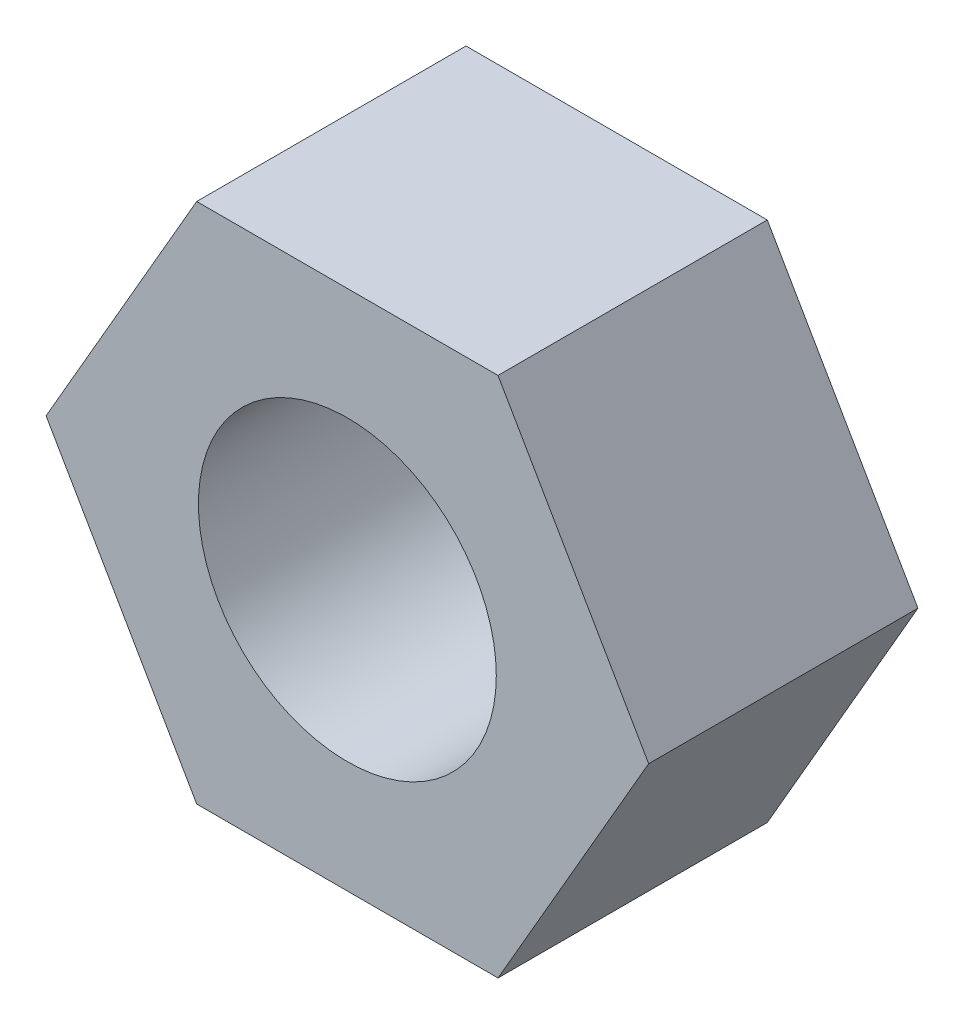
ISO-10303-21;
HEADER;
FILE_DESCRIPTION(('STEP AP214'),'2;1');
FILE_NAME('part.step','',(''),(''),'','','');
FILE_SCHEMA(('AUTOMOTIVE_DESIGN { 1 0 10303 214 1 1 1 1 }'));
ENDSEC;
DATA;
#1=APPLICATION_CONTEXT('core data for automotive mechanical design processes');
#2=APPLICATION_PROTOCOL_DEFINITION('international standard','automotive_design',2000,#1);
#3=PRODUCT_CONTEXT('',#1,'mechanical');
#4=PRODUCT('Part','Part','',(#3));
#5=PRODUCT_RELATED_PRODUCT_CATEGORY('part','',(#4));
#6=PRODUCT_DEFINITION_FORMATION('','',#4);
#7=PRODUCT_DEFINITION_CONTEXT('part definition',#1,'design');
#8=PRODUCT_DEFINITION('design','',#6,#7);
#9=PRODUCT_DEFINITION_SHAPE('','',#8);
#10=(LENGTH_UNIT() NAMED_UNIT(*) SI_UNIT(.MILLI.,.METRE.));
#11=(NAMED_UNIT(*) PLANE_ANGLE_UNIT() SI_UNIT($,.RADIAN.));
#12=(NAMED_UNIT(*) SI_UNIT($,.STERADIAN.) SOLID_ANGLE_UNIT());
#13=UNCERTAINTY_MEASURE_WITH_UNIT(LENGTH_MEASURE(1.E-05),#10,'distance_accuracy_value','');
#14=(GEOMETRIC_REPRESENTATION_CONTEXT(3) GLOBAL_UNCERTAINTY_ASSIGNED_CONTEXT((#13)) GLOBAL_UNIT_ASSIGNED_CONTEXT((#10,
#11,#12)) REPRESENTATION_CONTEXT('',''));
#15=CARTESIAN_POINT('',(0.,0.,0.));
#16=DIRECTION('',(0.,0.,1.));
#17=DIRECTION('',(1.,0.,0.));
#18=AXIS2_PLACEMENT_3D('',#15,#16,#17);
#19=CARTESIAN_POINT('',(-3.21156860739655,-5.56260000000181,5.74040000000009));
#20=DIRECTION('',(0.,1.00000000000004,0.));
#21=DIRECTION('',(-1.00000000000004,0.,0.));
#22=AXIS2_PLACEMENT_3D('',#19,#20,#21);
#23=PLANE('',#22);
#24=DIRECTION('',(1.00000000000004,0.,0.));
#25=VECTOR('',#24,1.);
#26=CARTESIAN_POINT('',(-3.21156860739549,-5.56260000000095,-2.77555756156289E-13));
#27=LINE('',#26,#25);
#28=CARTESIAN_POINT('',(-3.21156860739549,-5.56260000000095,-2.77555756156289E-13));
#29=VERTEX_POINT('',#28);
#30=CARTESIAN_POINT('',(3.21156860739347,-5.56260000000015,7.7715611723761E-13));
#31=VERTEX_POINT('',#30);
#32=EDGE_CURVE('E88',#29,#31,#27,.T.);
#33=ORIENTED_EDGE('',*,*,#32,.T.);
#34=DIRECTION('',(0.,0.,-1.));
#35=VECTOR('',#34,1.);
#36=CARTESIAN_POINT('',(3.21156860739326,-5.56259999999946,5.74039999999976));
#37=LINE('',#36,#35);
#38=CARTESIAN_POINT('',(3.21156860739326,-5.56259999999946,5.74039999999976));
#39=VERTEX_POINT('',#38);
#40=EDGE_CURVE('E11',#39,#31,#37,.T.);
#41=ORIENTED_EDGE('',*,*,#40,.F.);
#42=DIRECTION('',(1.00000000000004,0.,0.));
#43=VECTOR('',#42,1.);
#44=CARTESIAN_POINT('',(-3.21156860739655,-5.56260000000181,5.74040000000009));
#45=LINE('',#44,#43);
#46=CARTESIAN_POINT('',(-3.21156860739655,-5.56260000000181,5.74040000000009));
#47=VERTEX_POINT('',#46);
#48=EDGE_CURVE('E116',#47,#39,#45,.T.);
#49=ORIENTED_EDGE('',*,*,#48,.F.);
#50=DIRECTION('',(0.,0.,-1.));
#51=VECTOR('',#50,1.);
#52=CARTESIAN_POINT('',(-3.21156860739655,-5.56260000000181,5.74040000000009));
#53=LINE('',#52,#51);
#54=EDGE_CURVE('E101',#47,#29,#53,.T.);
#55=ORIENTED_EDGE('',*,*,#54,.T.);
#56=EDGE_LOOP('',(#33,#41,#49,#55));
#57=FACE_BOUND('',#56,.T.);
#58=ADVANCED_FACE('F32',(#57),#23,.F.);
#59=CARTESIAN_POINT('',(3.21156860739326,-5.56259999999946,5.74039999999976));
#60=DIRECTION('',(-0.866025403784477,0.500000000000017,0.));
#61=DIRECTION('',(-0.500000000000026,-0.866025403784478,0.));
#62=AXIS2_PLACEMENT_3D('',#59,#60,#61);
#63=PLANE('',#62);
#64=DIRECTION('',(0.500000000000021,0.866025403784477,0.));
#65=VECTOR('',#64,1.);
#66=CARTESIAN_POINT('',(3.21156860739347,-5.56260000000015,7.7715611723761E-13));
#67=LINE('',#66,#65);
#68=CARTESIAN_POINT('',(6.42313721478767,-2.2065682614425E-12,-5.55111512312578E-13));
#69=VERTEX_POINT('',#68);
#70=EDGE_CURVE('E84',#31,#69,#67,.T.);
#71=ORIENTED_EDGE('',*,*,#70,.T.);
#72=DIRECTION('',(0.,0.,-1.));
#73=VECTOR('',#72,1.);
#74=CARTESIAN_POINT('',(6.42313721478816,9.99200722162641E-13,5.74040000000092));
#75=LINE('',#74,#73);
#76=CARTESIAN_POINT('',(6.42313721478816,9.99200722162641E-13,5.74040000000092));
#77=VERTEX_POINT('',#76);
#78=EDGE_CURVE('E39',#77,#69,#75,.T.);
#79=ORIENTED_EDGE('',*,*,#78,.F.);
#80=DIRECTION('',(0.500000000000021,0.866025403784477,0.));
#81=VECTOR('',#80,1.);
#82=CARTESIAN_POINT('',(3.21156860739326,-5.56259999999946,5.74039999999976));
#83=LINE('',#82,#81);
#84=EDGE_CURVE('E97',#39,#77,#83,.T.);
#85=ORIENTED_EDGE('',*,*,#84,.F.);
#86=ORIENTED_EDGE('',*,*,#40,.T.);
#87=EDGE_LOOP('',(#71,#79,#85,#86));
#88=FACE_BOUND('',#87,.T.);
#89=ADVANCED_FACE('F96',(#88),#63,.F.);
#90=CARTESIAN_POINT('',(6.42313721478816,9.99200722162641E-13,5.74040000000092));
#91=DIRECTION('',(-0.866025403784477,-0.500000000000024,0.));
#92=DIRECTION('',(0.500000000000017,-0.866025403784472,0.));
#93=AXIS2_PLACEMENT_3D('',#90,#91,#92);
#94=PLANE('',#93);
#95=DIRECTION('',(-0.500000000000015,0.86602540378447,0.));
#96=VECTOR('',#95,1.);
#97=CARTESIAN_POINT('',(6.42313721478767,-2.2065682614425E-12,-5.55111512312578E-13));
#98=LINE('',#97,#96);
#99=CARTESIAN_POINT('',(3.21156860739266,5.5626000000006,1.88737914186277E-12));
#100=VERTEX_POINT('',#99);
#101=EDGE_CURVE('E90',#69,#100,#98,.T.);
#102=ORIENTED_EDGE('',*,*,#101,.T.);
#103=DIRECTION('',(0.,0.,-1.));
#104=VECTOR('',#103,1.);
#105=CARTESIAN_POINT('',(3.21156860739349,5.56260000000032,5.74040000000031));
#106=LINE('',#105,#104);
#107=CARTESIAN_POINT('',(3.21156860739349,5.56260000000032,5.74040000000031));
#108=VERTEX_POINT('',#107);
#109=EDGE_CURVE('E132',#108,#100,#106,.T.);
#110=ORIENTED_EDGE('',*,*,#109,.F.);
#111=DIRECTION('',(-0.500000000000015,0.86602540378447,0.));
#112=VECTOR('',#111,1.);
#113=CARTESIAN_POINT('',(6.42313721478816,9.99200722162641E-13,5.74040000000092));
#114=LINE('',#113,#112);
#115=EDGE_CURVE('E119',#77,#108,#114,.T.);
#116=ORIENTED_EDGE('',*,*,#115,.F.);
#117=ORIENTED_EDGE('',*,*,#78,.T.);
#118=EDGE_LOOP('',(#102,#110,#116,#117));
#119=FACE_BOUND('',#118,.T.);
#120=ADVANCED_FACE('F136',(#119),#94,.F.);
#121=CARTESIAN_POINT('',(3.21156860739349,5.56260000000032,5.74040000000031));
#122=DIRECTION('',(0.,-1.00000000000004,0.));
#123=DIRECTION('',(1.00000000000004,0.,0.));
#124=AXIS2_PLACEMENT_3D('',#121,#122,#123);
#125=PLANE('',#124);
#126=DIRECTION('',(-1.00000000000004,0.,0.));
#127=VECTOR('',#126,1.);
#128=CARTESIAN_POINT('',(3.21156860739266,5.5626000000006,1.88737914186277E-12));
#129=LINE('',#128,#127);
#130=CARTESIAN_POINT('',(-3.21156860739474,5.56259999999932,-2.22044604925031E-13));
#131=VERTEX_POINT('',#130);
#132=EDGE_CURVE('E110',#100,#131,#129,.T.);
#133=ORIENTED_EDGE('',*,*,#132,.T.);
#134=DIRECTION('',(0.,0.,-1.));
#135=VECTOR('',#134,1.);
#136=CARTESIAN_POINT('',(-3.21156860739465,5.56259999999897,5.74039999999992));
#137=LINE('',#136,#135);
#138=CARTESIAN_POINT('',(-3.21156860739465,5.56259999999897,5.74039999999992));
#139=VERTEX_POINT('',#138);
#140=EDGE_CURVE('E129',#139,#131,#137,.T.);
#141=ORIENTED_EDGE('',*,*,#140,.F.);
#142=DIRECTION('',(-1.00000000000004,0.,0.));
#143=VECTOR('',#142,1.);
#144=CARTESIAN_POINT('',(3.21156860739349,5.56260000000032,5.74040000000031));
#145=LINE('',#144,#143);
#146=EDGE_CURVE('E121',#108,#139,#145,.T.);
#147=ORIENTED_EDGE('',*,*,#146,.F.);
#148=ORIENTED_EDGE('',*,*,#109,.T.);
#149=EDGE_LOOP('',(#133,#141,#147,#148));
#150=FACE_BOUND('',#149,.T.);
#151=ADVANCED_FACE('F142',(#150),#125,.F.);
#152=CARTESIAN_POINT('',(-3.21156860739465,5.56259999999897,5.74039999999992));
#153=DIRECTION('',(0.866025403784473,-0.500000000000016,0.));
#154=DIRECTION('',(0.500000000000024,0.866025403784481,0.));
#155=AXIS2_PLACEMENT_3D('',#152,#153,#154);
#156=PLANE('',#155);
#157=DIRECTION('',(-0.500000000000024,-0.866025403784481,0.));
#158=VECTOR('',#157,1.);
#159=CARTESIAN_POINT('',(-3.21156860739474,5.56259999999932,-2.22044604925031E-13));
#160=LINE('',#159,#158);
#161=CARTESIAN_POINT('',(-6.42313721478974,-3.7470027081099E-13,-8.88178419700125E-13));
#162=VERTEX_POINT('',#161);
#163=EDGE_CURVE('E112',#131,#162,#160,.T.);
#164=ORIENTED_EDGE('',*,*,#163,.T.);
#165=DIRECTION('',(0.,0.,-1.));
#166=VECTOR('',#165,1.);
#167=CARTESIAN_POINT('',(-6.42313721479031,-1.40165656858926E-12,5.74039999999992));
#168=LINE('',#167,#166);
#169=CARTESIAN_POINT('',(-6.42313721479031,-1.40165656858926E-12,5.74039999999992));
#170=VERTEX_POINT('',#169);
#171=EDGE_CURVE('E126',#170,#162,#168,.T.);
#172=ORIENTED_EDGE('',*,*,#171,.F.);
#173=DIRECTION('',(-0.500000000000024,-0.866025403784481,0.));
#174=VECTOR('',#173,1.);
#175=CARTESIAN_POINT('',(-3.21156860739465,5.56259999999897,5.74039999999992));
#176=LINE('',#175,#174);
#177=EDGE_CURVE('E51',#139,#170,#176,.T.);
#178=ORIENTED_EDGE('',*,*,#177,.F.);
#179=ORIENTED_EDGE('',*,*,#140,.T.);
#180=EDGE_LOOP('',(#164,#172,#178,#179));
#181=FACE_BOUND('',#180,.T.);
#182=ADVANCED_FACE('F145',(#181),#156,.F.);
#183=CARTESIAN_POINT('',(-6.42313721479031,-1.40165656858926E-12,5.74039999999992));
#184=DIRECTION('',(0.866025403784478,0.500000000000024,0.));
#185=DIRECTION('',(-0.500000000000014,0.866025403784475,0.));
#186=AXIS2_PLACEMENT_3D('',#183,#184,#185);
#187=PLANE('',#186);
#188=DIRECTION('',(0.500000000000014,-0.866025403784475,0.));
#189=VECTOR('',#188,1.);
#190=CARTESIAN_POINT('',(-6.42313721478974,-3.7470027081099E-13,-8.88178419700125E-13));
#191=LINE('',#190,#189);
#192=EDGE_CURVE('E114',#162,#29,#191,.T.);
#193=ORIENTED_EDGE('',*,*,#192,.T.);
#194=ORIENTED_EDGE('',*,*,#54,.F.);
#195=DIRECTION('',(0.500000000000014,-0.866025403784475,0.));
#196=VECTOR('',#195,1.);
#197=CARTESIAN_POINT('',(-6.42313721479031,-1.40165656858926E-12,5.74039999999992));
#198=LINE('',#197,#196);
#199=EDGE_CURVE('E46',#170,#47,#198,.T.);
#200=ORIENTED_EDGE('',*,*,#199,.F.);
#201=ORIENTED_EDGE('',*,*,#171,.T.);
#202=EDGE_LOOP('',(#193,#194,#200,#201));
#203=FACE_BOUND('',#202,.T.);
#204=ADVANCED_FACE('F147',(#203),#187,.F.);
#205=CARTESIAN_POINT('',(-3.21156860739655,-5.56260000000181,5.74040000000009));
#206=DIRECTION('',(0.,0.,-1.));
#207=DIRECTION('',(-1.00000000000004,0.,0.));
#208=AXIS2_PLACEMENT_3D('',#205,#206,#207);
#209=PLANE('',#208);
#210=CARTESIAN_POINT('',(-6.48786580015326E-13,0.,5.74039999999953));
#211=DIRECTION('',(0.,0.,1.));
#212=DIRECTION('',(1.00000000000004,0.,0.));
#213=AXIS2_PLACEMENT_3D('',#210,#211,#212);
#214=CIRCLE('',#213,3.175);
#215=CARTESIAN_POINT('',(3.17499999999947,0.,5.74039999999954));
#216=VERTEX_POINT('',#215);
#217=EDGE_CURVE('E105',#216,#216,#214,.T.);
#218=ORIENTED_EDGE('',*,*,#217,.F.);
#219=EDGE_LOOP('',(#218));
#220=FACE_BOUND('',#219,.T.);
#221=ORIENTED_EDGE('',*,*,#48,.T.);
#222=ORIENTED_EDGE('',*,*,#84,.T.);
#223=ORIENTED_EDGE('',*,*,#115,.T.);
#224=ORIENTED_EDGE('',*,*,#146,.T.);
#225=ORIENTED_EDGE('',*,*,#177,.T.);
#226=ORIENTED_EDGE('',*,*,#199,.T.);
#227=EDGE_LOOP('',(#221,#222,#223,#224,#225,#226));
#228=FACE_BOUND('',#227,.T.);
#229=ADVANCED_FACE('F139',(#220,#228),#209,.F.);
#230=CARTESIAN_POINT('',(-3.21156860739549,-5.56260000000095,-2.77555756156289E-13));
#231=DIRECTION('',(0.,0.,-1.));
#232=DIRECTION('',(-1.00000000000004,0.,0.));
#233=AXIS2_PLACEMENT_3D('',#230,#231,#232);
#234=PLANE('',#233);
#235=CARTESIAN_POINT('',(-1.26287869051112E-12,0.,1.66533453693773E-13));
#236=DIRECTION('',(0.,0.,1.));
#237=DIRECTION('',(1.00000000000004,0.,0.));
#238=AXIS2_PLACEMENT_3D('',#235,#236,#237);
#239=CIRCLE('',#238,3.175);
#240=CARTESIAN_POINT('',(3.17499999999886,0.,1.68560432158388E-13));
#241=VERTEX_POINT('',#240);
#242=EDGE_CURVE('E102',#241,#241,#239,.T.);
#243=ORIENTED_EDGE('',*,*,#242,.T.);
#244=EDGE_LOOP('',(#243));
#245=FACE_BOUND('',#244,.T.);
#246=ORIENTED_EDGE('',*,*,#32,.F.);
#247=ORIENTED_EDGE('',*,*,#192,.F.);
#248=ORIENTED_EDGE('',*,*,#163,.F.);
#249=ORIENTED_EDGE('',*,*,#132,.F.);
#250=ORIENTED_EDGE('',*,*,#101,.F.);
#251=ORIENTED_EDGE('',*,*,#70,.F.);
#252=EDGE_LOOP('',(#246,#247,#248,#249,#250,#251));
#253=FACE_BOUND('',#252,.T.);
#254=ADVANCED_FACE('F85',(#245,#253),#234,.T.);
#255=CARTESIAN_POINT('',(-1.26287869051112E-12,0.,1.66533453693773E-13));
#256=DIRECTION('',(0.,0.,1.));
#257=DIRECTION('',(1.00000000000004,0.,0.));
#258=AXIS2_PLACEMENT_3D('',#255,#256,#257);
#259=CYLINDRICAL_SURFACE('',#258,3.175);
#260=ORIENTED_EDGE('',*,*,#242,.F.);
#261=EDGE_LOOP('',(#260));
#262=FACE_BOUND('',#261,.T.);
#263=ORIENTED_EDGE('',*,*,#217,.T.);
#264=EDGE_LOOP('',(#263));
#265=FACE_BOUND('',#264,.T.);
#266=ADVANCED_FACE('F194',(#262,#265),#259,.F.);
#267=CLOSED_SHELL('',(#58,#89,#120,#151,#182,#204,#229,#254,#266));
#268=MANIFOLD_SOLID_BREP('B2',#267);
#269=ADVANCED_BREP_SHAPE_REPRESENTATION('',(#18,#268),#14);
#270=SHAPE_DEFINITION_REPRESENTATION(#9,#269);
ENDSEC;
END-ISO-10303-21;
